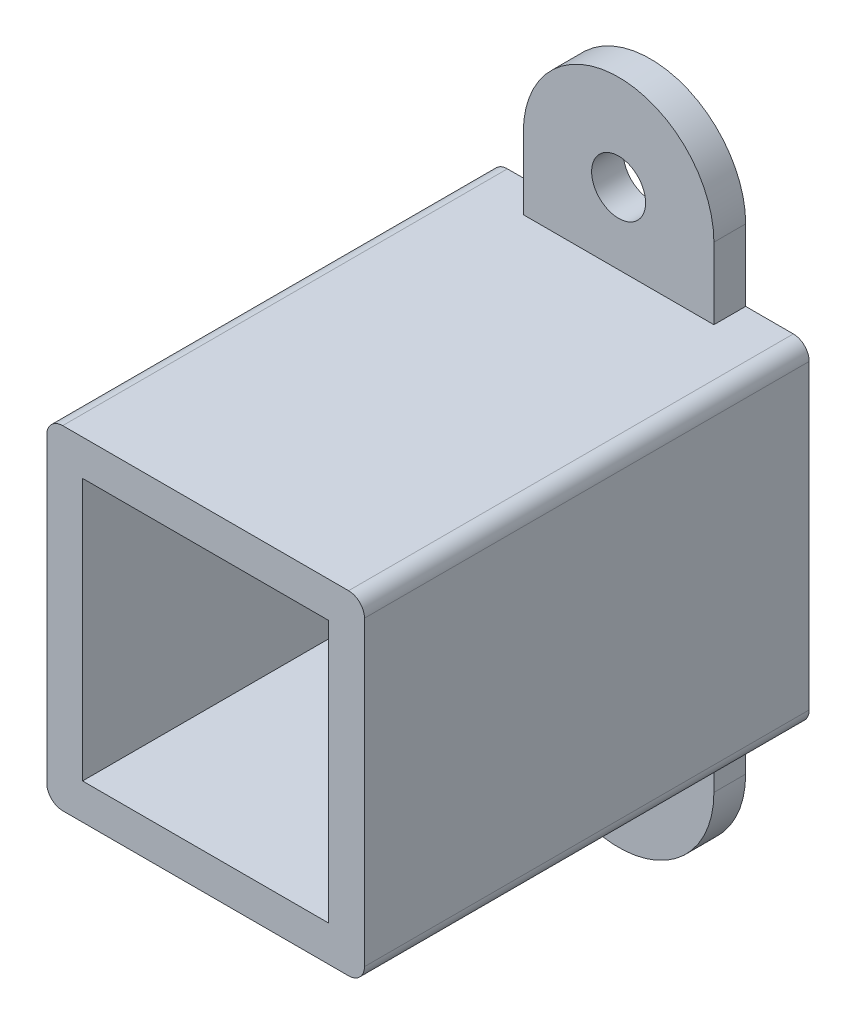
ISO-10303-21;
HEADER;
FILE_DESCRIPTION(('STEP AP214'),'2;1');
FILE_NAME('part.step','',(''),(''),'','','');
FILE_SCHEMA(('AUTOMOTIVE_DESIGN { 1 0 10303 214 1 1 1 1 }'));
ENDSEC;
DATA;
#1=APPLICATION_CONTEXT('core data for automotive mechanical design processes');
#2=APPLICATION_PROTOCOL_DEFINITION('international standard','automotive_design',2000,#1);
#3=PRODUCT_CONTEXT('',#1,'mechanical');
#4=PRODUCT('Part','Part','',(#3));
#5=PRODUCT_RELATED_PRODUCT_CATEGORY('part','',(#4));
#6=PRODUCT_DEFINITION_FORMATION('','',#4);
#7=PRODUCT_DEFINITION_CONTEXT('part definition',#1,'design');
#8=PRODUCT_DEFINITION('design','',#6,#7);
#9=PRODUCT_DEFINITION_SHAPE('','',#8);
#10=(LENGTH_UNIT() NAMED_UNIT(*) SI_UNIT(.MILLI.,.METRE.));
#11=(NAMED_UNIT(*) PLANE_ANGLE_UNIT() SI_UNIT($,.RADIAN.));
#12=(NAMED_UNIT(*) SI_UNIT($,.STERADIAN.) SOLID_ANGLE_UNIT());
#13=UNCERTAINTY_MEASURE_WITH_UNIT(LENGTH_MEASURE(1.E-05),#10,'distance_accuracy_value','');
#14=(GEOMETRIC_REPRESENTATION_CONTEXT(3) GLOBAL_UNCERTAINTY_ASSIGNED_CONTEXT((#13)) GLOBAL_UNIT_ASSIGNED_CONTEXT((#10,
#11,#12)) REPRESENTATION_CONTEXT('',''));
#15=CARTESIAN_POINT('',(0.,0.,0.));
#16=DIRECTION('',(0.,0.,1.));
#17=DIRECTION('',(1.,0.,0.));
#18=AXIS2_PLACEMENT_3D('',#15,#16,#17);
#19=CARTESIAN_POINT('',(0.,0.,0.));
#20=DIRECTION('',(0.,0.,-1.));
#21=DIRECTION('',(-1.,0.,0.));
#22=AXIS2_PLACEMENT_3D('',#19,#20,#21);
#23=PLANE('',#22);
#24=CARTESIAN_POINT('',(0.,15.,0.));
#25=DIRECTION('',(0.,0.,1.));
#26=DIRECTION('',(1.,0.,0.));
#27=AXIS2_PLACEMENT_3D('',#24,#25,#26);
#28=CIRCLE('',#27,1.7);
#29=CARTESIAN_POINT('',(1.7,15.,0.));
#30=VERTEX_POINT('',#29);
#31=EDGE_CURVE('E603',#30,#30,#28,.T.);
#32=ORIENTED_EDGE('',*,*,#31,.T.);
#33=EDGE_LOOP('',(#32));
#34=FACE_BOUND('',#33,.T.);
#35=DIRECTION('',(-1.,0.,0.));
#36=VECTOR('',#35,1.);
#37=CARTESIAN_POINT('',(-10.,10.5,0.));
#38=LINE('',#37,#36);
#39=CARTESIAN_POINT('',(9.,10.5,0.));
#40=VERTEX_POINT('',#39);
#41=CARTESIAN_POINT('',(6.,10.5,0.));
#42=VERTEX_POINT('',#41);
#43=EDGE_CURVE('E291',#40,#42,#38,.T.);
#44=ORIENTED_EDGE('',*,*,#43,.F.);
#45=CARTESIAN_POINT('',(9.,9.5,0.));
#46=DIRECTION('',(0.,0.,-1.));
#47=DIRECTION('',(-1.,0.,0.));
#48=AXIS2_PLACEMENT_3D('',#45,#46,#47);
#49=CIRCLE('',#48,1.);
#50=CARTESIAN_POINT('',(10.,9.49999999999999,0.));
#51=VERTEX_POINT('',#50);
#52=EDGE_CURVE('E311',#40,#51,#49,.T.);
#53=ORIENTED_EDGE('',*,*,#52,.T.);
#54=DIRECTION('',(0.,1.,0.));
#55=VECTOR('',#54,1.);
#56=CARTESIAN_POINT('',(10.,-10.5,0.));
#57=LINE('',#56,#55);
#58=CARTESIAN_POINT('',(10.,-9.5,0.));
#59=VERTEX_POINT('',#58);
#60=EDGE_CURVE('E275',#59,#51,#57,.T.);
#61=ORIENTED_EDGE('',*,*,#60,.F.);
#62=CARTESIAN_POINT('',(9.,-9.5,0.));
#63=DIRECTION('',(0.,0.,-1.));
#64=DIRECTION('',(-1.,0.,0.));
#65=AXIS2_PLACEMENT_3D('',#62,#63,#64);
#66=CIRCLE('',#65,1.);
#67=CARTESIAN_POINT('',(9.,-10.5,0.));
#68=VERTEX_POINT('',#67);
#69=EDGE_CURVE('E309',#59,#68,#66,.T.);
#70=ORIENTED_EDGE('',*,*,#69,.T.);
#71=DIRECTION('',(1.,0.,0.));
#72=VECTOR('',#71,1.);
#73=CARTESIAN_POINT('',(-10.,-10.5,0.));
#74=LINE('',#73,#72);
#75=CARTESIAN_POINT('',(6.,-10.5,0.));
#76=VERTEX_POINT('',#75);
#77=EDGE_CURVE('E296',#76,#68,#74,.T.);
#78=ORIENTED_EDGE('',*,*,#77,.F.);
#79=DIRECTION('',(0.,-1.,0.));
#80=VECTOR('',#79,1.);
#81=CARTESIAN_POINT('',(6.,-15.,0.));
#82=LINE('',#81,#80);
#83=CARTESIAN_POINT('',(6.,-15.,0.));
#84=VERTEX_POINT('',#83);
#85=EDGE_CURVE('E220',#76,#84,#82,.T.);
#86=ORIENTED_EDGE('',*,*,#85,.T.);
#87=CARTESIAN_POINT('',(0.,-15.,0.));
#88=DIRECTION('',(0.,0.,-1.));
#89=DIRECTION('',(-1.,0.,0.));
#90=AXIS2_PLACEMENT_3D('',#87,#88,#89);
#91=CIRCLE('',#90,6.);
#92=CARTESIAN_POINT('',(-6.,-15.,0.));
#93=VERTEX_POINT('',#92);
#94=EDGE_CURVE('E198',#84,#93,#91,.T.);
#95=ORIENTED_EDGE('',*,*,#94,.T.);
#96=DIRECTION('',(0.,1.,0.));
#97=VECTOR('',#96,1.);
#98=CARTESIAN_POINT('',(-6.,-15.,0.));
#99=LINE('',#98,#97);
#100=CARTESIAN_POINT('',(-6.,-10.5,0.));
#101=VERTEX_POINT('',#100);
#102=EDGE_CURVE('E195',#93,#101,#99,.T.);
#103=ORIENTED_EDGE('',*,*,#102,.T.);
#104=CARTESIAN_POINT('',(-9.,-10.5,0.));
#105=VERTEX_POINT('',#104);
#106=EDGE_CURVE('E280',#105,#101,#74,.T.);
#107=ORIENTED_EDGE('',*,*,#106,.F.);
#108=CARTESIAN_POINT('',(-9.,-9.5,0.));
#109=DIRECTION('',(0.,0.,-1.));
#110=DIRECTION('',(-1.,0.,0.));
#111=AXIS2_PLACEMENT_3D('',#108,#109,#110);
#112=CIRCLE('',#111,1.);
#113=CARTESIAN_POINT('',(-10.,-9.5,0.));
#114=VERTEX_POINT('',#113);
#115=EDGE_CURVE('E307',#105,#114,#112,.T.);
#116=ORIENTED_EDGE('',*,*,#115,.T.);
#117=DIRECTION('',(0.,-1.,0.));
#118=VECTOR('',#117,1.);
#119=CARTESIAN_POINT('',(-10.,-10.5,0.));
#120=LINE('',#119,#118);
#121=CARTESIAN_POINT('',(-10.,9.49999999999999,0.));
#122=VERTEX_POINT('',#121);
#123=EDGE_CURVE('E293',#122,#114,#120,.T.);
#124=ORIENTED_EDGE('',*,*,#123,.F.);
#125=CARTESIAN_POINT('',(-9.,9.5,0.));
#126=DIRECTION('',(0.,0.,-1.));
#127=DIRECTION('',(-1.,0.,0.));
#128=AXIS2_PLACEMENT_3D('',#125,#126,#127);
#129=CIRCLE('',#128,1.);
#130=CARTESIAN_POINT('',(-9.,10.5,0.));
#131=VERTEX_POINT('',#130);
#132=EDGE_CURVE('E305',#122,#131,#129,.T.);
#133=ORIENTED_EDGE('',*,*,#132,.T.);
#134=CARTESIAN_POINT('',(-5.99999999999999,10.5,0.));
#135=VERTEX_POINT('',#134);
#136=EDGE_CURVE('E290',#135,#131,#38,.T.);
#137=ORIENTED_EDGE('',*,*,#136,.F.);
#138=DIRECTION('',(0.,1.,0.));
#139=VECTOR('',#138,1.);
#140=CARTESIAN_POINT('',(-5.99999999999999,10.5,0.));
#141=LINE('',#140,#139);
#142=CARTESIAN_POINT('',(-6.,15.,0.));
#143=VERTEX_POINT('',#142);
#144=EDGE_CURVE('E214',#135,#143,#141,.T.);
#145=ORIENTED_EDGE('',*,*,#144,.T.);
#146=CARTESIAN_POINT('',(0.,15.,0.));
#147=DIRECTION('',(0.,0.,-1.));
#148=DIRECTION('',(-1.,0.,0.));
#149=AXIS2_PLACEMENT_3D('',#146,#147,#148);
#150=CIRCLE('',#149,6.);
#151=CARTESIAN_POINT('',(6.,15.,0.));
#152=VERTEX_POINT('',#151);
#153=EDGE_CURVE('E175',#143,#152,#150,.T.);
#154=ORIENTED_EDGE('',*,*,#153,.T.);
#155=DIRECTION('',(0.,-1.,0.));
#156=VECTOR('',#155,1.);
#157=CARTESIAN_POINT('',(6.,10.5,0.));
#158=LINE('',#157,#156);
#159=EDGE_CURVE('E217',#152,#42,#158,.T.);
#160=ORIENTED_EDGE('',*,*,#159,.T.);
#161=EDGE_LOOP('',(#44,#53,#61,#70,#78,#86,#95,#103,#107,#116,#124,#133,#137,#145,#154,#160));
#162=FACE_BOUND('',#161,.T.);
#163=CARTESIAN_POINT('',(0.,-15.,0.));
#164=DIRECTION('',(0.,0.,1.));
#165=DIRECTION('',(1.,0.,0.));
#166=AXIS2_PLACEMENT_3D('',#163,#164,#165);
#167=CIRCLE('',#166,1.7);
#168=CARTESIAN_POINT('',(1.7,-15.,0.));
#169=VERTEX_POINT('',#168);
#170=EDGE_CURVE('E201',#169,#169,#167,.T.);
#171=ORIENTED_EDGE('',*,*,#170,.T.);
#172=EDGE_LOOP('',(#171));
#173=FACE_BOUND('',#172,.T.);
#174=ADVANCED_FACE('F32',(#34,#162,#173),#23,.T.);
#175=CARTESIAN_POINT('',(0.,-15.,2.));
#176=DIRECTION('',(0.,0.,-1.));
#177=DIRECTION('',(-1.,0.,0.));
#178=AXIS2_PLACEMENT_3D('',#175,#176,#177);
#179=PLANE('',#178);
#180=DIRECTION('',(0.,-1.,0.));
#181=VECTOR('',#180,1.);
#182=CARTESIAN_POINT('',(6.,-15.,2.));
#183=LINE('',#182,#181);
#184=CARTESIAN_POINT('',(6.,-10.5,2.));
#185=VERTEX_POINT('',#184);
#186=CARTESIAN_POINT('',(6.,-15.,2.));
#187=VERTEX_POINT('',#186);
#188=EDGE_CURVE('E205',#185,#187,#183,.T.);
#189=ORIENTED_EDGE('',*,*,#188,.F.);
#190=DIRECTION('',(-1.,0.,0.));
#191=VECTOR('',#190,1.);
#192=CARTESIAN_POINT('',(-10.,-10.5,2.));
#193=LINE('',#192,#191);
#194=CARTESIAN_POINT('',(-6.,-10.5,2.));
#195=VERTEX_POINT('',#194);
#196=EDGE_CURVE('E249',#185,#195,#193,.T.);
#197=ORIENTED_EDGE('',*,*,#196,.T.);
#198=DIRECTION('',(0.,1.,0.));
#199=VECTOR('',#198,1.);
#200=CARTESIAN_POINT('',(-6.,-15.,2.));
#201=LINE('',#200,#199);
#202=CARTESIAN_POINT('',(-6.,-15.,2.));
#203=VERTEX_POINT('',#202);
#204=EDGE_CURVE('E211',#203,#195,#201,.T.);
#205=ORIENTED_EDGE('',*,*,#204,.F.);
#206=CARTESIAN_POINT('',(0.,-15.,2.));
#207=DIRECTION('',(0.,0.,-1.));
#208=DIRECTION('',(-1.,0.,0.));
#209=AXIS2_PLACEMENT_3D('',#206,#207,#208);
#210=CIRCLE('',#209,6.);
#211=EDGE_CURVE('E208',#187,#203,#210,.T.);
#212=ORIENTED_EDGE('',*,*,#211,.F.);
#213=EDGE_LOOP('',(#189,#197,#205,#212));
#214=FACE_BOUND('',#213,.T.);
#215=CARTESIAN_POINT('',(0.,-15.,2.));
#216=DIRECTION('',(0.,0.,1.));
#217=DIRECTION('',(1.,0.,0.));
#218=AXIS2_PLACEMENT_3D('',#215,#216,#217);
#219=CIRCLE('',#218,1.7);
#220=CARTESIAN_POINT('',(1.7,-15.,2.));
#221=VERTEX_POINT('',#220);
#222=EDGE_CURVE('E605',#221,#221,#219,.T.);
#223=ORIENTED_EDGE('',*,*,#222,.F.);
#224=EDGE_LOOP('',(#223));
#225=FACE_BOUND('',#224,.T.);
#226=ADVANCED_FACE('F370',(#214,#225),#179,.F.);
#227=CARTESIAN_POINT('',(7.75,-8.25,28.));
#228=DIRECTION('',(-1.,0.,0.));
#229=DIRECTION('',(0.,0.,1.));
#230=AXIS2_PLACEMENT_3D('',#227,#228,#229);
#231=PLANE('',#230);
#232=DIRECTION('',(0.,0.,-1.));
#233=VECTOR('',#232,1.);
#234=CARTESIAN_POINT('',(7.75,8.25,28.));
#235=LINE('',#234,#233);
#236=CARTESIAN_POINT('',(7.75,8.25,28.));
#237=VERTEX_POINT('',#236);
#238=CARTESIAN_POINT('',(7.75,8.25,2.));
#239=VERTEX_POINT('',#238);
#240=EDGE_CURVE('E272',#237,#239,#235,.T.);
#241=ORIENTED_EDGE('',*,*,#240,.T.);
#242=DIRECTION('',(0.,-1.,0.));
#243=VECTOR('',#242,1.);
#244=CARTESIAN_POINT('',(7.75,-8.25,2.));
#245=LINE('',#244,#243);
#246=CARTESIAN_POINT('',(7.75,-8.25,2.));
#247=VERTEX_POINT('',#246);
#248=EDGE_CURVE('E246',#239,#247,#245,.T.);
#249=ORIENTED_EDGE('',*,*,#248,.T.);
#250=DIRECTION('',(0.,0.,-1.));
#251=VECTOR('',#250,1.);
#252=CARTESIAN_POINT('',(7.75,-8.25,28.));
#253=LINE('',#252,#251);
#254=CARTESIAN_POINT('',(7.75,-8.25,28.));
#255=VERTEX_POINT('',#254);
#256=EDGE_CURVE('E263',#255,#247,#253,.T.);
#257=ORIENTED_EDGE('',*,*,#256,.F.);
#258=DIRECTION('',(0.,1.,0.));
#259=VECTOR('',#258,1.);
#260=CARTESIAN_POINT('',(7.75,-8.25,28.));
#261=LINE('',#260,#259);
#262=EDGE_CURVE('E254',#255,#237,#261,.T.);
#263=ORIENTED_EDGE('',*,*,#262,.T.);
#264=EDGE_LOOP('',(#241,#249,#257,#263));
#265=FACE_BOUND('',#264,.T.);
#266=ADVANCED_FACE('F376',(#265),#231,.T.);
#267=CARTESIAN_POINT('',(-7.75,8.25,28.));
#268=DIRECTION('',(0.,-1.,0.));
#269=DIRECTION('',(0.,0.,-1.));
#270=AXIS2_PLACEMENT_3D('',#267,#268,#269);
#271=PLANE('',#270);
#272=DIRECTION('',(0.,0.,-1.));
#273=VECTOR('',#272,1.);
#274=CARTESIAN_POINT('',(-7.75,8.25,28.));
#275=LINE('',#274,#273);
#276=CARTESIAN_POINT('',(-7.75,8.25,28.));
#277=VERTEX_POINT('',#276);
#278=CARTESIAN_POINT('',(-7.75,8.25,2.));
#279=VERTEX_POINT('',#278);
#280=EDGE_CURVE('E269',#277,#279,#275,.T.);
#281=ORIENTED_EDGE('',*,*,#280,.T.);
#282=DIRECTION('',(1.,0.,0.));
#283=VECTOR('',#282,1.);
#284=CARTESIAN_POINT('',(-7.75,8.25,2.));
#285=LINE('',#284,#283);
#286=EDGE_CURVE('E243',#279,#239,#285,.T.);
#287=ORIENTED_EDGE('',*,*,#286,.T.);
#288=ORIENTED_EDGE('',*,*,#240,.F.);
#289=DIRECTION('',(-1.,0.,0.));
#290=VECTOR('',#289,1.);
#291=CARTESIAN_POINT('',(-7.75,8.25,28.));
#292=LINE('',#291,#290);
#293=EDGE_CURVE('E256',#237,#277,#292,.T.);
#294=ORIENTED_EDGE('',*,*,#293,.T.);
#295=EDGE_LOOP('',(#281,#287,#288,#294));
#296=FACE_BOUND('',#295,.T.);
#297=ADVANCED_FACE('F547',(#296),#271,.T.);
#298=CARTESIAN_POINT('',(-7.75,-8.25,28.));
#299=DIRECTION('',(1.,0.,0.));
#300=DIRECTION('',(0.,0.,-1.));
#301=AXIS2_PLACEMENT_3D('',#298,#299,#300);
#302=PLANE('',#301);
#303=DIRECTION('',(0.,0.,-1.));
#304=VECTOR('',#303,1.);
#305=CARTESIAN_POINT('',(-7.75,-8.25,28.));
#306=LINE('',#305,#304);
#307=CARTESIAN_POINT('',(-7.75,-8.25,28.));
#308=VERTEX_POINT('',#307);
#309=CARTESIAN_POINT('',(-7.75,-8.25,2.));
#310=VERTEX_POINT('',#309);
#311=EDGE_CURVE('E266',#308,#310,#306,.T.);
#312=ORIENTED_EDGE('',*,*,#311,.T.);
#313=DIRECTION('',(0.,1.,0.));
#314=VECTOR('',#313,1.);
#315=CARTESIAN_POINT('',(-7.75,-8.25,2.));
#316=LINE('',#315,#314);
#317=EDGE_CURVE('E228',#310,#279,#316,.T.);
#318=ORIENTED_EDGE('',*,*,#317,.T.);
#319=ORIENTED_EDGE('',*,*,#280,.F.);
#320=DIRECTION('',(0.,-1.,0.));
#321=VECTOR('',#320,1.);
#322=CARTESIAN_POINT('',(-7.75,-8.25,28.));
#323=LINE('',#322,#321);
#324=EDGE_CURVE('E258',#277,#308,#323,.T.);
#325=ORIENTED_EDGE('',*,*,#324,.T.);
#326=EDGE_LOOP('',(#312,#318,#319,#325));
#327=FACE_BOUND('',#326,.T.);
#328=ADVANCED_FACE('F554',(#327),#302,.T.);
#329=CARTESIAN_POINT('',(-7.75,-8.25,28.));
#330=DIRECTION('',(0.,1.,0.));
#331=DIRECTION('',(0.,0.,1.));
#332=AXIS2_PLACEMENT_3D('',#329,#330,#331);
#333=PLANE('',#332);
#334=ORIENTED_EDGE('',*,*,#256,.T.);
#335=DIRECTION('',(-1.,0.,0.));
#336=VECTOR('',#335,1.);
#337=CARTESIAN_POINT('',(-7.75,-8.25,2.));
#338=LINE('',#337,#336);
#339=EDGE_CURVE('E287',#247,#310,#338,.T.);
#340=ORIENTED_EDGE('',*,*,#339,.T.);
#341=ORIENTED_EDGE('',*,*,#311,.F.);
#342=DIRECTION('',(1.,0.,0.));
#343=VECTOR('',#342,1.);
#344=CARTESIAN_POINT('',(-7.75,-8.25,28.));
#345=LINE('',#344,#343);
#346=EDGE_CURVE('E261',#308,#255,#345,.T.);
#347=ORIENTED_EDGE('',*,*,#346,.T.);
#348=EDGE_LOOP('',(#334,#340,#341,#347));
#349=FACE_BOUND('',#348,.T.);
#350=ADVANCED_FACE('F450',(#349),#333,.T.);
#351=CARTESIAN_POINT('',(0.,0.,28.));
#352=DIRECTION('',(0.,0.,-1.));
#353=DIRECTION('',(-1.,0.,0.));
#354=AXIS2_PLACEMENT_3D('',#351,#352,#353);
#355=PLANE('',#354);
#356=DIRECTION('',(0.,1.,0.));
#357=VECTOR('',#356,1.);
#358=CARTESIAN_POINT('',(10.,-10.5,28.));
#359=LINE('',#358,#357);
#360=CARTESIAN_POINT('',(10.,-9.5,28.));
#361=VERTEX_POINT('',#360);
#362=CARTESIAN_POINT('',(10.,9.49999999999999,28.));
#363=VERTEX_POINT('',#362);
#364=EDGE_CURVE('E276',#361,#363,#359,.T.);
#365=ORIENTED_EDGE('',*,*,#364,.T.);
#366=CARTESIAN_POINT('',(9.,9.5,28.));
#367=DIRECTION('',(0.,0.,-1.));
#368=DIRECTION('',(-1.,0.,0.));
#369=AXIS2_PLACEMENT_3D('',#366,#367,#368);
#370=CIRCLE('',#369,1.);
#371=CARTESIAN_POINT('',(9.,10.5,28.));
#372=VERTEX_POINT('',#371);
#373=EDGE_CURVE('E323',#363,#372,#370,.F.);
#374=ORIENTED_EDGE('',*,*,#373,.T.);
#375=DIRECTION('',(-1.,0.,0.));
#376=VECTOR('',#375,1.);
#377=CARTESIAN_POINT('',(-10.,10.5,28.));
#378=LINE('',#377,#376);
#379=CARTESIAN_POINT('',(-9.,10.5,28.));
#380=VERTEX_POINT('',#379);
#381=EDGE_CURVE('E279',#372,#380,#378,.T.);
#382=ORIENTED_EDGE('',*,*,#381,.T.);
#383=CARTESIAN_POINT('',(-9.,9.5,28.));
#384=DIRECTION('',(0.,0.,-1.));
#385=DIRECTION('',(-1.,0.,0.));
#386=AXIS2_PLACEMENT_3D('',#383,#384,#385);
#387=CIRCLE('',#386,1.);
#388=CARTESIAN_POINT('',(-10.,9.49999999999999,28.));
#389=VERTEX_POINT('',#388);
#390=EDGE_CURVE('E318',#380,#389,#387,.F.);
#391=ORIENTED_EDGE('',*,*,#390,.T.);
#392=DIRECTION('',(0.,-1.,0.));
#393=VECTOR('',#392,1.);
#394=CARTESIAN_POINT('',(-10.,-10.5,28.));
#395=LINE('',#394,#393);
#396=CARTESIAN_POINT('',(-10.,-9.5,28.));
#397=VERTEX_POINT('',#396);
#398=EDGE_CURVE('E283',#389,#397,#395,.T.);
#399=ORIENTED_EDGE('',*,*,#398,.T.);
#400=CARTESIAN_POINT('',(-9.,-9.5,28.));
#401=DIRECTION('',(0.,0.,-1.));
#402=DIRECTION('',(-1.,0.,0.));
#403=AXIS2_PLACEMENT_3D('',#400,#401,#402);
#404=CIRCLE('',#403,1.);
#405=CARTESIAN_POINT('',(-9.,-10.5,28.));
#406=VERTEX_POINT('',#405);
#407=EDGE_CURVE('E54',#397,#406,#404,.F.);
#408=ORIENTED_EDGE('',*,*,#407,.T.);
#409=DIRECTION('',(1.,0.,0.));
#410=VECTOR('',#409,1.);
#411=CARTESIAN_POINT('',(-10.,-10.5,28.));
#412=LINE('',#411,#410);
#413=CARTESIAN_POINT('',(9.,-10.5,28.));
#414=VERTEX_POINT('',#413);
#415=EDGE_CURVE('E285',#406,#414,#412,.T.);
#416=ORIENTED_EDGE('',*,*,#415,.T.);
#417=CARTESIAN_POINT('',(9.,-9.5,28.));
#418=DIRECTION('',(0.,0.,-1.));
#419=DIRECTION('',(-1.,0.,0.));
#420=AXIS2_PLACEMENT_3D('',#417,#418,#419);
#421=CIRCLE('',#420,1.);
#422=EDGE_CURVE('E321',#414,#361,#421,.F.);
#423=ORIENTED_EDGE('',*,*,#422,.T.);
#424=EDGE_LOOP('',(#365,#374,#382,#391,#399,#408,#416,#423));
#425=FACE_BOUND('',#424,.T.);
#426=ORIENTED_EDGE('',*,*,#262,.F.);
#427=ORIENTED_EDGE('',*,*,#346,.F.);
#428=ORIENTED_EDGE('',*,*,#324,.F.);
#429=ORIENTED_EDGE('',*,*,#293,.F.);
#430=EDGE_LOOP('',(#426,#427,#428,#429));
#431=FACE_BOUND('',#430,.T.);
#432=ADVANCED_FACE('F347',(#425,#431),#355,.F.);
#433=CARTESIAN_POINT('',(10.,-10.5,28.));
#434=DIRECTION('',(-1.,0.,0.));
#435=DIRECTION('',(0.,0.,1.));
#436=AXIS2_PLACEMENT_3D('',#433,#434,#435);
#437=PLANE('',#436);
#438=ORIENTED_EDGE('',*,*,#60,.T.);
#439=DIRECTION('',(0.,0.,-1.));
#440=VECTOR('',#439,1.);
#441=CARTESIAN_POINT('',(10.,9.5,28.));
#442=LINE('',#441,#440);
#443=EDGE_CURVE('E316',#51,#363,#442,.F.);
#444=ORIENTED_EDGE('',*,*,#443,.T.);
#445=ORIENTED_EDGE('',*,*,#364,.F.);
#446=DIRECTION('',(0.,0.,-1.));
#447=VECTOR('',#446,1.);
#448=CARTESIAN_POINT('',(10.,-9.5,28.));
#449=LINE('',#448,#447);
#450=EDGE_CURVE('E313',#361,#59,#449,.T.);
#451=ORIENTED_EDGE('',*,*,#450,.T.);
#452=EDGE_LOOP('',(#438,#444,#445,#451));
#453=FACE_BOUND('',#452,.T.);
#454=ADVANCED_FACE('F355',(#453),#437,.F.);
#455=CARTESIAN_POINT('',(-10.,10.5,28.));
#456=DIRECTION('',(0.,-1.,0.));
#457=DIRECTION('',(0.,0.,-1.));
#458=AXIS2_PLACEMENT_3D('',#455,#456,#457);
#459=PLANE('',#458);
#460=ORIENTED_EDGE('',*,*,#381,.F.);
#461=DIRECTION('',(0.,0.,-1.));
#462=VECTOR('',#461,1.);
#463=CARTESIAN_POINT('',(9.,10.5,28.));
#464=LINE('',#463,#462);
#465=EDGE_CURVE('E302',#372,#40,#464,.T.);
#466=ORIENTED_EDGE('',*,*,#465,.T.);
#467=ORIENTED_EDGE('',*,*,#43,.T.);
#468=DIRECTION('',(0.,0.,-1.));
#469=VECTOR('',#468,1.);
#470=CARTESIAN_POINT('',(6.,10.5,2.));
#471=LINE('',#470,#469);
#472=CARTESIAN_POINT('',(6.,10.5,2.));
#473=VERTEX_POINT('',#472);
#474=EDGE_CURVE('E236',#473,#42,#471,.T.);
#475=ORIENTED_EDGE('',*,*,#474,.F.);
#476=DIRECTION('',(1.,0.,0.));
#477=VECTOR('',#476,1.);
#478=CARTESIAN_POINT('',(-10.,10.5,2.));
#479=LINE('',#478,#477);
#480=CARTESIAN_POINT('',(-5.99999999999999,10.5,2.));
#481=VERTEX_POINT('',#480);
#482=EDGE_CURVE('E252',#481,#473,#479,.T.);
#483=ORIENTED_EDGE('',*,*,#482,.F.);
#484=DIRECTION('',(0.,0.,-1.));
#485=VECTOR('',#484,1.);
#486=CARTESIAN_POINT('',(-5.99999999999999,10.5,2.));
#487=LINE('',#486,#485);
#488=EDGE_CURVE('E181',#481,#135,#487,.T.);
#489=ORIENTED_EDGE('',*,*,#488,.T.);
#490=ORIENTED_EDGE('',*,*,#136,.T.);
#491=DIRECTION('',(0.,0.,-1.));
#492=VECTOR('',#491,1.);
#493=CARTESIAN_POINT('',(-9.,10.5,28.));
#494=LINE('',#493,#492);
#495=EDGE_CURVE('E300',#131,#380,#494,.F.);
#496=ORIENTED_EDGE('',*,*,#495,.T.);
#497=EDGE_LOOP('',(#460,#466,#467,#475,#483,#489,#490,#496));
#498=FACE_BOUND('',#497,.T.);
#499=ADVANCED_FACE('F363',(#498),#459,.F.);
#500=CARTESIAN_POINT('',(-10.,-10.5,28.));
#501=DIRECTION('',(1.,0.,0.));
#502=DIRECTION('',(0.,0.,-1.));
#503=AXIS2_PLACEMENT_3D('',#500,#501,#502);
#504=PLANE('',#503);
#505=ORIENTED_EDGE('',*,*,#123,.T.);
#506=DIRECTION('',(0.,0.,-1.));
#507=VECTOR('',#506,1.);
#508=CARTESIAN_POINT('',(-10.,-9.5,28.));
#509=LINE('',#508,#507);
#510=EDGE_CURVE('E11',#114,#397,#509,.F.);
#511=ORIENTED_EDGE('',*,*,#510,.T.);
#512=ORIENTED_EDGE('',*,*,#398,.F.);
#513=DIRECTION('',(0.,0.,-1.));
#514=VECTOR('',#513,1.);
#515=CARTESIAN_POINT('',(-10.,9.5,28.));
#516=LINE('',#515,#514);
#517=EDGE_CURVE('E40',#389,#122,#516,.T.);
#518=ORIENTED_EDGE('',*,*,#517,.T.);
#519=EDGE_LOOP('',(#505,#511,#512,#518));
#520=FACE_BOUND('',#519,.T.);
#521=ADVANCED_FACE('F333',(#520),#504,.F.);
#522=CARTESIAN_POINT('',(-10.,-10.5,28.));
#523=DIRECTION('',(0.,1.,0.));
#524=DIRECTION('',(0.,0.,1.));
#525=AXIS2_PLACEMENT_3D('',#522,#523,#524);
#526=PLANE('',#525);
#527=ORIENTED_EDGE('',*,*,#77,.T.);
#528=DIRECTION('',(0.,0.,-1.));
#529=VECTOR('',#528,1.);
#530=CARTESIAN_POINT('',(9.,-10.5,28.));
#531=LINE('',#530,#529);
#532=EDGE_CURVE('E47',#68,#414,#531,.F.);
#533=ORIENTED_EDGE('',*,*,#532,.T.);
#534=ORIENTED_EDGE('',*,*,#415,.F.);
#535=DIRECTION('',(0.,0.,-1.));
#536=VECTOR('',#535,1.);
#537=CARTESIAN_POINT('',(-9.,-10.5,28.));
#538=LINE('',#537,#536);
#539=EDGE_CURVE('E325',#406,#105,#538,.T.);
#540=ORIENTED_EDGE('',*,*,#539,.T.);
#541=ORIENTED_EDGE('',*,*,#106,.T.);
#542=DIRECTION('',(0.,0.,-1.));
#543=VECTOR('',#542,1.);
#544=CARTESIAN_POINT('',(-6.,-10.5,2.));
#545=LINE('',#544,#543);
#546=EDGE_CURVE('E225',#195,#101,#545,.T.);
#547=ORIENTED_EDGE('',*,*,#546,.F.);
#548=ORIENTED_EDGE('',*,*,#196,.F.);
#549=DIRECTION('',(0.,0.,-1.));
#550=VECTOR('',#549,1.);
#551=CARTESIAN_POINT('',(6.,-10.5,2.));
#552=LINE('',#551,#550);
#553=EDGE_CURVE('E233',#185,#76,#552,.T.);
#554=ORIENTED_EDGE('',*,*,#553,.T.);
#555=EDGE_LOOP('',(#527,#533,#534,#540,#541,#547,#548,#554));
#556=FACE_BOUND('',#555,.T.);
#557=ADVANCED_FACE('F345',(#556),#526,.F.);
#558=ORIENTED_EDGE('',*,*,#248,.F.);
#559=ORIENTED_EDGE('',*,*,#286,.F.);
#560=ORIENTED_EDGE('',*,*,#317,.F.);
#561=ORIENTED_EDGE('',*,*,#339,.F.);
#562=EDGE_LOOP('',(#558,#559,#560,#561));
#563=FACE_BOUND('',#562,.T.);
#564=ADVANCED_FACE('F379',(#563),#179,.F.);
#565=CARTESIAN_POINT('',(0.,-15.,2.));
#566=DIRECTION('',(0.,0.,-1.));
#567=DIRECTION('',(-1.,0.,0.));
#568=AXIS2_PLACEMENT_3D('',#565,#566,#567);
#569=CYLINDRICAL_SURFACE('',#568,6.);
#570=ORIENTED_EDGE('',*,*,#94,.F.);
#571=DIRECTION('',(0.,0.,-1.));
#572=VECTOR('',#571,1.);
#573=CARTESIAN_POINT('',(6.,-15.,2.));
#574=LINE('',#573,#572);
#575=EDGE_CURVE('E231',#187,#84,#574,.T.);
#576=ORIENTED_EDGE('',*,*,#575,.F.);
#577=ORIENTED_EDGE('',*,*,#211,.T.);
#578=DIRECTION('',(0.,0.,-1.));
#579=VECTOR('',#578,1.);
#580=CARTESIAN_POINT('',(-6.,-15.,2.));
#581=LINE('',#580,#579);
#582=EDGE_CURVE('E229',#203,#93,#581,.T.);
#583=ORIENTED_EDGE('',*,*,#582,.T.);
#584=EDGE_LOOP('',(#570,#576,#577,#583));
#585=FACE_BOUND('',#584,.T.);
#586=ADVANCED_FACE('F482',(#585),#569,.T.);
#587=CARTESIAN_POINT('',(6.,-15.,2.));
#588=DIRECTION('',(1.,0.,0.));
#589=DIRECTION('',(0.,0.,-1.));
#590=AXIS2_PLACEMENT_3D('',#587,#588,#589);
#591=PLANE('',#590);
#592=ORIENTED_EDGE('',*,*,#85,.F.);
#593=ORIENTED_EDGE('',*,*,#553,.F.);
#594=ORIENTED_EDGE('',*,*,#188,.T.);
#595=ORIENTED_EDGE('',*,*,#575,.T.);
#596=EDGE_LOOP('',(#592,#593,#594,#595));
#597=FACE_BOUND('',#596,.T.);
#598=ADVANCED_FACE('F490',(#597),#591,.T.);
#599=CARTESIAN_POINT('',(-6.,-15.,2.));
#600=DIRECTION('',(-1.,0.,0.));
#601=DIRECTION('',(0.,0.,1.));
#602=AXIS2_PLACEMENT_3D('',#599,#600,#601);
#603=PLANE('',#602);
#604=ORIENTED_EDGE('',*,*,#102,.F.);
#605=ORIENTED_EDGE('',*,*,#582,.F.);
#606=ORIENTED_EDGE('',*,*,#204,.T.);
#607=ORIENTED_EDGE('',*,*,#546,.T.);
#608=EDGE_LOOP('',(#604,#605,#606,#607));
#609=FACE_BOUND('',#608,.T.);
#610=ADVANCED_FACE('F498',(#609),#603,.T.);
#611=CARTESIAN_POINT('',(0.,15.,2.));
#612=DIRECTION('',(0.,0.,1.));
#613=DIRECTION('',(1.,0.,0.));
#614=AXIS2_PLACEMENT_3D('',#611,#612,#613);
#615=CIRCLE('',#614,1.7);
#616=CARTESIAN_POINT('',(1.7,15.,2.));
#617=VERTEX_POINT('',#616);
#618=EDGE_CURVE('E601',#617,#617,#615,.T.);
#619=ORIENTED_EDGE('',*,*,#618,.F.);
#620=EDGE_LOOP('',(#619));
#621=FACE_BOUND('',#620,.T.);
#622=DIRECTION('',(0.,1.,0.));
#623=VECTOR('',#622,1.);
#624=CARTESIAN_POINT('',(-5.99999999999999,10.5,2.));
#625=LINE('',#624,#623);
#626=CARTESIAN_POINT('',(-6.,15.,2.));
#627=VERTEX_POINT('',#626);
#628=EDGE_CURVE('E188',#481,#627,#625,.T.);
#629=ORIENTED_EDGE('',*,*,#628,.F.);
#630=ORIENTED_EDGE('',*,*,#482,.T.);
#631=DIRECTION('',(0.,-1.,0.));
#632=VECTOR('',#631,1.);
#633=CARTESIAN_POINT('',(6.,10.5,2.));
#634=LINE('',#633,#632);
#635=CARTESIAN_POINT('',(6.,15.,2.));
#636=VERTEX_POINT('',#635);
#637=EDGE_CURVE('E190',#636,#473,#634,.T.);
#638=ORIENTED_EDGE('',*,*,#637,.F.);
#639=CARTESIAN_POINT('',(0.,15.,2.));
#640=DIRECTION('',(0.,0.,-1.));
#641=DIRECTION('',(-1.,0.,0.));
#642=AXIS2_PLACEMENT_3D('',#639,#640,#641);
#643=CIRCLE('',#642,6.);
#644=EDGE_CURVE('E173',#627,#636,#643,.T.);
#645=ORIENTED_EDGE('',*,*,#644,.F.);
#646=EDGE_LOOP('',(#629,#630,#638,#645));
#647=FACE_BOUND('',#646,.T.);
#648=ADVANCED_FACE('F186',(#621,#647),#179,.F.);
#649=CARTESIAN_POINT('',(6.,10.5,2.));
#650=DIRECTION('',(1.,0.,0.));
#651=DIRECTION('',(0.,0.,-1.));
#652=AXIS2_PLACEMENT_3D('',#649,#650,#651);
#653=PLANE('',#652);
#654=ORIENTED_EDGE('',*,*,#159,.F.);
#655=DIRECTION('',(0.,0.,-1.));
#656=VECTOR('',#655,1.);
#657=CARTESIAN_POINT('',(6.,15.,2.));
#658=LINE('',#657,#656);
#659=EDGE_CURVE('E180',#636,#152,#658,.T.);
#660=ORIENTED_EDGE('',*,*,#659,.F.);
#661=ORIENTED_EDGE('',*,*,#637,.T.);
#662=ORIENTED_EDGE('',*,*,#474,.T.);
#663=EDGE_LOOP('',(#654,#660,#661,#662));
#664=FACE_BOUND('',#663,.T.);
#665=ADVANCED_FACE('F513',(#664),#653,.T.);
#666=CARTESIAN_POINT('',(0.,15.,2.));
#667=DIRECTION('',(0.,0.,-1.));
#668=DIRECTION('',(-1.,0.,0.));
#669=AXIS2_PLACEMENT_3D('',#666,#667,#668);
#670=CYLINDRICAL_SURFACE('',#669,6.);
#671=ORIENTED_EDGE('',*,*,#153,.F.);
#672=DIRECTION('',(0.,0.,-1.));
#673=VECTOR('',#672,1.);
#674=CARTESIAN_POINT('',(-6.,15.,2.));
#675=LINE('',#674,#673);
#676=EDGE_CURVE('E170',#627,#143,#675,.T.);
#677=ORIENTED_EDGE('',*,*,#676,.F.);
#678=ORIENTED_EDGE('',*,*,#644,.T.);
#679=ORIENTED_EDGE('',*,*,#659,.T.);
#680=EDGE_LOOP('',(#671,#677,#678,#679));
#681=FACE_BOUND('',#680,.T.);
#682=ADVANCED_FACE('F172',(#681),#670,.T.);
#683=CARTESIAN_POINT('',(-5.99999999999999,10.5,2.));
#684=DIRECTION('',(-1.,0.,0.));
#685=DIRECTION('',(0.,-1.,0.));
#686=AXIS2_PLACEMENT_3D('',#683,#684,#685);
#687=PLANE('',#686);
#688=ORIENTED_EDGE('',*,*,#144,.F.);
#689=ORIENTED_EDGE('',*,*,#488,.F.);
#690=ORIENTED_EDGE('',*,*,#628,.T.);
#691=ORIENTED_EDGE('',*,*,#676,.T.);
#692=EDGE_LOOP('',(#688,#689,#690,#691));
#693=FACE_BOUND('',#692,.T.);
#694=ADVANCED_FACE('F193',(#693),#687,.T.);
#695=CARTESIAN_POINT('',(0.,-15.,2.));
#696=DIRECTION('',(0.,0.,1.));
#697=DIRECTION('',(1.,0.,0.));
#698=AXIS2_PLACEMENT_3D('',#695,#696,#697);
#699=CYLINDRICAL_SURFACE('',#698,1.7);
#700=ORIENTED_EDGE('',*,*,#170,.F.);
#701=EDGE_LOOP('',(#700));
#702=FACE_BOUND('',#701,.T.);
#703=ORIENTED_EDGE('',*,*,#222,.T.);
#704=EDGE_LOOP('',(#703));
#705=FACE_BOUND('',#704,.T.);
#706=ADVANCED_FACE('F425',(#702,#705),#699,.F.);
#707=CARTESIAN_POINT('',(0.,15.,2.));
#708=DIRECTION('',(0.,0.,1.));
#709=DIRECTION('',(1.,0.,0.));
#710=AXIS2_PLACEMENT_3D('',#707,#708,#709);
#711=CYLINDRICAL_SURFACE('',#710,1.7);
#712=ORIENTED_EDGE('',*,*,#31,.F.);
#713=EDGE_LOOP('',(#712));
#714=FACE_BOUND('',#713,.T.);
#715=ORIENTED_EDGE('',*,*,#618,.T.);
#716=EDGE_LOOP('',(#715));
#717=FACE_BOUND('',#716,.T.);
#718=ADVANCED_FACE('F394',(#714,#717),#711,.F.);
#719=CARTESIAN_POINT('',(9.,9.5,28.));
#720=DIRECTION('',(0.,0.,-1.));
#721=DIRECTION('',(-1.,0.,0.));
#722=AXIS2_PLACEMENT_3D('',#719,#720,#721);
#723=CYLINDRICAL_SURFACE('',#722,1.);
#724=ORIENTED_EDGE('',*,*,#373,.F.);
#725=ORIENTED_EDGE('',*,*,#443,.F.);
#726=ORIENTED_EDGE('',*,*,#52,.F.);
#727=ORIENTED_EDGE('',*,*,#465,.F.);
#728=EDGE_LOOP('',(#724,#725,#726,#727));
#729=FACE_BOUND('',#728,.T.);
#730=ADVANCED_FACE('F360',(#729),#723,.T.);
#731=CARTESIAN_POINT('',(9.,-9.5,28.));
#732=DIRECTION('',(0.,0.,-1.));
#733=DIRECTION('',(-1.,0.,0.));
#734=AXIS2_PLACEMENT_3D('',#731,#732,#733);
#735=CYLINDRICAL_SURFACE('',#734,1.);
#736=ORIENTED_EDGE('',*,*,#422,.F.);
#737=ORIENTED_EDGE('',*,*,#532,.F.);
#738=ORIENTED_EDGE('',*,*,#69,.F.);
#739=ORIENTED_EDGE('',*,*,#450,.F.);
#740=EDGE_LOOP('',(#736,#737,#738,#739));
#741=FACE_BOUND('',#740,.T.);
#742=ADVANCED_FACE('F352',(#741),#735,.T.);
#743=CARTESIAN_POINT('',(-9.,-9.5,28.));
#744=DIRECTION('',(0.,0.,-1.));
#745=DIRECTION('',(-1.,0.,0.));
#746=AXIS2_PLACEMENT_3D('',#743,#744,#745);
#747=CYLINDRICAL_SURFACE('',#746,1.);
#748=ORIENTED_EDGE('',*,*,#407,.F.);
#749=ORIENTED_EDGE('',*,*,#510,.F.);
#750=ORIENTED_EDGE('',*,*,#115,.F.);
#751=ORIENTED_EDGE('',*,*,#539,.F.);
#752=EDGE_LOOP('',(#748,#749,#750,#751));
#753=FACE_BOUND('',#752,.T.);
#754=ADVANCED_FACE('F344',(#753),#747,.T.);
#755=CARTESIAN_POINT('',(-9.,9.5,28.));
#756=DIRECTION('',(0.,0.,-1.));
#757=DIRECTION('',(-1.,0.,0.));
#758=AXIS2_PLACEMENT_3D('',#755,#756,#757);
#759=CYLINDRICAL_SURFACE('',#758,1.);
#760=ORIENTED_EDGE('',*,*,#390,.F.);
#761=ORIENTED_EDGE('',*,*,#495,.F.);
#762=ORIENTED_EDGE('',*,*,#132,.F.);
#763=ORIENTED_EDGE('',*,*,#517,.F.);
#764=EDGE_LOOP('',(#760,#761,#762,#763));
#765=FACE_BOUND('',#764,.T.);
#766=ADVANCED_FACE('F34',(#765),#759,.T.);
#767=CLOSED_SHELL('',(#174,#226,#266,#297,#328,#350,#432,#454,#499,#521,#557,#564,#586,#598,
#610,#648,#665,#682,#694,#706,#718,#730,#742,#754,#766));
#768=MANIFOLD_SOLID_BREP('B2',#767);
#769=ADVANCED_BREP_SHAPE_REPRESENTATION('',(#18,#768),#14);
#770=SHAPE_DEFINITION_REPRESENTATION(#9,#769);
ENDSEC;
END-ISO-10303-21;
